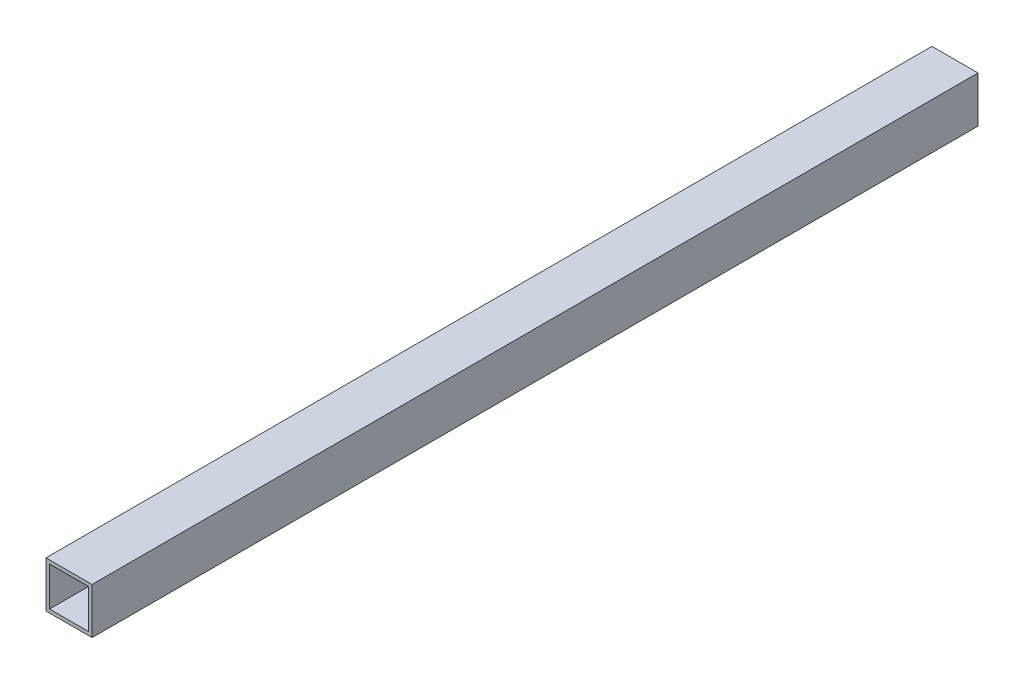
from build123d import *

# Parameters (mm, degrees)
SKETCH1_W           = 26
SKETCH1_H           = 26
SKETCH1_W_2         = 22
SKETCH1_H_2         = 22
BOSS_EXTRUDE1_DEPTH = 500


with BuildPart() as part:
    # Sketch1 → Boss-Extrude1 (new body)
    with BuildSketch(Plane.XY):
        Rectangle(SKETCH1_W, SKETCH1_H)
        Rectangle(SKETCH1_W_2, SKETCH1_H_2, mode=Mode.SUBTRACT)
    extrude(amount=BOSS_EXTRUDE1_DEPTH)


solid = part.part
